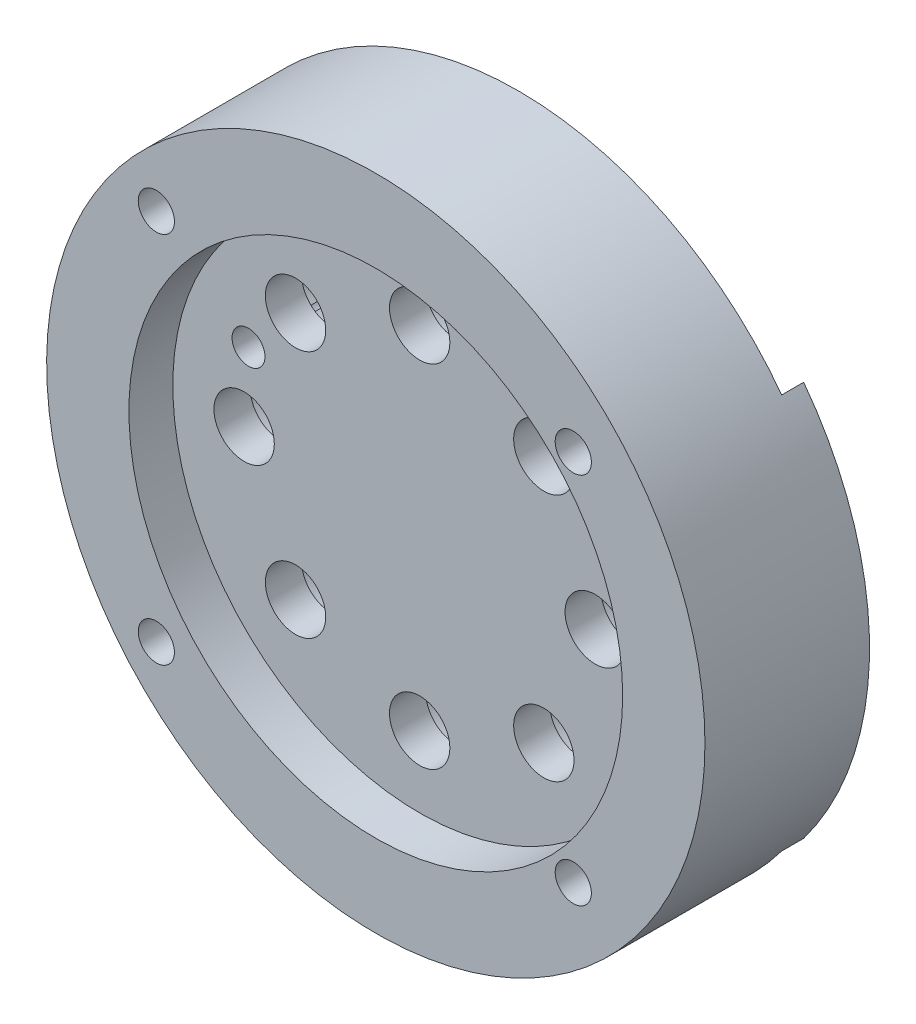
ISO-10303-21;
HEADER;
FILE_DESCRIPTION(('STEP AP214'),'2;1');
FILE_NAME('part.step','',(''),(''),'','','');
FILE_SCHEMA(('AUTOMOTIVE_DESIGN { 1 0 10303 214 1 1 1 1 }'));
ENDSEC;
DATA;
#1=APPLICATION_CONTEXT('core data for automotive mechanical design processes');
#2=APPLICATION_PROTOCOL_DEFINITION('international standard','automotive_design',2000,#1);
#3=PRODUCT_CONTEXT('',#1,'mechanical');
#4=PRODUCT('Part','Part','',(#3));
#5=PRODUCT_RELATED_PRODUCT_CATEGORY('part','',(#4));
#6=PRODUCT_DEFINITION_FORMATION('','',#4);
#7=PRODUCT_DEFINITION_CONTEXT('part definition',#1,'design');
#8=PRODUCT_DEFINITION('design','',#6,#7);
#9=PRODUCT_DEFINITION_SHAPE('','',#8);
#10=(LENGTH_UNIT() NAMED_UNIT(*) SI_UNIT(.MILLI.,.METRE.));
#11=(NAMED_UNIT(*) PLANE_ANGLE_UNIT() SI_UNIT($,.RADIAN.));
#12=(NAMED_UNIT(*) SI_UNIT($,.STERADIAN.) SOLID_ANGLE_UNIT());
#13=UNCERTAINTY_MEASURE_WITH_UNIT(LENGTH_MEASURE(1.E-05),#10,'distance_accuracy_value','');
#14=(GEOMETRIC_REPRESENTATION_CONTEXT(3) GLOBAL_UNCERTAINTY_ASSIGNED_CONTEXT((#13)) GLOBAL_UNIT_ASSIGNED_CONTEXT((#10,
#11,#12)) REPRESENTATION_CONTEXT('',''));
#15=CARTESIAN_POINT('',(0.,0.,0.));
#16=DIRECTION('',(0.,0.,1.));
#17=DIRECTION('',(1.,0.,0.));
#18=AXIS2_PLACEMENT_3D('',#15,#16,#17);
#19=CARTESIAN_POINT('',(-395.662294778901,108.726328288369,0.));
#20=DIRECTION('',(0.,0.,1.));
#21=DIRECTION('',(1.,0.,0.));
#22=AXIS2_PLACEMENT_3D('',#19,#20,#21);
#23=PLANE('',#22);
#24=CARTESIAN_POINT('',(-395.662294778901,108.726328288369,0.));
#25=DIRECTION('',(0.,0.,1.));
#26=DIRECTION('',(1.,0.,0.));
#27=AXIS2_PLACEMENT_3D('',#24,#25,#26);
#28=CIRCLE('',#27,30.);
#29=CARTESIAN_POINT('',(-421.662736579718,123.692190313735,0.));
#30=VERTEX_POINT('',#29);
#31=CARTESIAN_POINT('',(-421.662736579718,93.7604662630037,0.));
#32=VERTEX_POINT('',#31);
#33=EDGE_CURVE('E94',#30,#32,#28,.T.);
#34=ORIENTED_EDGE('',*,*,#33,.F.);
#35=DIRECTION('',(0.,1.,0.));
#36=VECTOR('',#35,1.);
#37=CARTESIAN_POINT('',(-421.662736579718,73.7263282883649,0.));
#38=LINE('',#37,#36);
#39=EDGE_CURVE('E84',#32,#30,#38,.T.);
#40=ORIENTED_EDGE('',*,*,#39,.F.);
#41=EDGE_LOOP('',(#34,#40));
#42=FACE_BOUND('',#41,.T.);
#43=ADVANCED_FACE('F16',(#42),#23,.F.);
#44=CARTESIAN_POINT('',(-371.662736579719,90.7257392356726,0.));
#45=VERTEX_POINT('',#44);
#46=CARTESIAN_POINT('',(-371.662736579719,126.726917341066,0.));
#47=VERTEX_POINT('',#46);
#48=EDGE_CURVE('E101',#45,#47,#28,.T.);
#49=ORIENTED_EDGE('',*,*,#48,.F.);
#50=DIRECTION('',(0.,-1.,0.));
#51=VECTOR('',#50,1.);
#52=CARTESIAN_POINT('',(-371.662736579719,73.7263282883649,0.));
#53=LINE('',#52,#51);
#54=EDGE_CURVE('E95',#47,#45,#53,.T.);
#55=ORIENTED_EDGE('',*,*,#54,.F.);
#56=EDGE_LOOP('',(#49,#55));
#57=FACE_BOUND('',#56,.T.);
#58=ADVANCED_FACE('F165',(#57),#23,.F.);
#59=CARTESIAN_POINT('',(-395.662294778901,108.726328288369,15.));
#60=DIRECTION('',(0.,0.,-1.));
#61=DIRECTION('',(-1.,0.,0.));
#62=AXIS2_PLACEMENT_3D('',#59,#60,#61);
#63=CYLINDRICAL_SURFACE('',#62,30.);
#64=CARTESIAN_POINT('',(-395.662294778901,108.726328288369,2.));
#65=DIRECTION('',(0.,0.,1.));
#66=DIRECTION('',(1.,0.,0.));
#67=AXIS2_PLACEMENT_3D('',#64,#65,#66);
#68=CIRCLE('',#67,30.);
#69=CARTESIAN_POINT('',(-371.662736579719,126.726917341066,2.));
#70=VERTEX_POINT('',#69);
#71=CARTESIAN_POINT('',(-421.662736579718,123.692190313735,2.));
#72=VERTEX_POINT('',#71);
#73=EDGE_CURVE('E159',#70,#72,#68,.T.);
#74=ORIENTED_EDGE('',*,*,#73,.T.);
#75=DIRECTION('',(0.,0.,-1.));
#76=VECTOR('',#75,1.);
#77=CARTESIAN_POINT('',(-421.662736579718,123.692190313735,15.));
#78=LINE('',#77,#76);
#79=EDGE_CURVE('E11',#72,#30,#78,.T.);
#80=ORIENTED_EDGE('',*,*,#79,.T.);
#81=ORIENTED_EDGE('',*,*,#33,.T.);
#82=DIRECTION('',(0.,0.,-1.));
#83=VECTOR('',#82,1.);
#84=CARTESIAN_POINT('',(-421.662736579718,93.7604662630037,15.));
#85=LINE('',#84,#83);
#86=CARTESIAN_POINT('',(-421.662736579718,93.7604662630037,2.));
#87=VERTEX_POINT('',#86);
#88=EDGE_CURVE('E81',#32,#87,#85,.F.);
#89=ORIENTED_EDGE('',*,*,#88,.T.);
#90=CARTESIAN_POINT('',(-371.662736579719,90.7257392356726,2.));
#91=VERTEX_POINT('',#90);
#92=EDGE_CURVE('E192',#87,#91,#68,.T.);
#93=ORIENTED_EDGE('',*,*,#92,.T.);
#94=DIRECTION('',(0.,0.,-1.));
#95=VECTOR('',#94,1.);
#96=CARTESIAN_POINT('',(-371.662736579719,90.7257392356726,15.));
#97=LINE('',#96,#95);
#98=EDGE_CURVE('E90',#91,#45,#97,.T.);
#99=ORIENTED_EDGE('',*,*,#98,.T.);
#100=ORIENTED_EDGE('',*,*,#48,.T.);
#101=DIRECTION('',(0.,0.,-1.));
#102=VECTOR('',#101,1.);
#103=CARTESIAN_POINT('',(-371.662736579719,126.726917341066,15.));
#104=LINE('',#103,#102);
#105=EDGE_CURVE('E24',#47,#70,#104,.F.);
#106=ORIENTED_EDGE('',*,*,#105,.T.);
#107=EDGE_LOOP('',(#74,#80,#81,#89,#93,#99,#100,#106));
#108=FACE_BOUND('',#107,.T.);
#109=CARTESIAN_POINT('',(-395.662294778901,108.726328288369,15.));
#110=DIRECTION('',(0.,0.,1.));
#111=DIRECTION('',(1.,0.,0.));
#112=AXIS2_PLACEMENT_3D('',#109,#110,#111);
#113=CIRCLE('',#112,30.);
#114=CARTESIAN_POINT('',(-365.662294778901,108.726328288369,15.));
#115=VERTEX_POINT('',#114);
#116=EDGE_CURVE('E100',#115,#115,#113,.T.);
#117=ORIENTED_EDGE('',*,*,#116,.F.);
#118=EDGE_LOOP('',(#117));
#119=FACE_BOUND('',#118,.T.);
#120=ADVANCED_FACE('F18',(#108,#119),#63,.T.);
#121=CARTESIAN_POINT('',(-395.662294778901,108.726328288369,15.));
#122=DIRECTION('',(0.,0.,1.));
#123=DIRECTION('',(1.,0.,0.));
#124=AXIS2_PLACEMENT_3D('',#121,#122,#123);
#125=PLANE('',#124);
#126=CARTESIAN_POINT('',(-377.662736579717,91.7263282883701,15.));
#127=DIRECTION('',(0.,0.,-1.));
#128=DIRECTION('',(-1.,0.,0.));
#129=AXIS2_PLACEMENT_3D('',#126,#127,#128);
#130=CIRCLE('',#129,1.65);
#131=CARTESIAN_POINT('',(-379.312736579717,91.7263282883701,15.));
#132=VERTEX_POINT('',#131);
#133=EDGE_CURVE('E400',#132,#132,#130,.T.);
#134=ORIENTED_EDGE('',*,*,#133,.T.);
#135=EDGE_LOOP('',(#134));
#136=FACE_BOUND('',#135,.T.);
#137=CARTESIAN_POINT('',(-377.662736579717,125.72632828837,15.));
#138=DIRECTION('',(0.,0.,-1.));
#139=DIRECTION('',(-1.,0.,0.));
#140=AXIS2_PLACEMENT_3D('',#137,#138,#139);
#141=CIRCLE('',#140,1.65);
#142=CARTESIAN_POINT('',(-379.312736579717,125.72632828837,15.));
#143=VERTEX_POINT('',#142);
#144=EDGE_CURVE('E410',#143,#143,#141,.T.);
#145=ORIENTED_EDGE('',*,*,#144,.T.);
#146=EDGE_LOOP('',(#145));
#147=FACE_BOUND('',#146,.T.);
#148=CARTESIAN_POINT('',(-415.662736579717,125.72632828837,15.));
#149=DIRECTION('',(0.,0.,-1.));
#150=DIRECTION('',(-1.,0.,0.));
#151=AXIS2_PLACEMENT_3D('',#148,#149,#150);
#152=CIRCLE('',#151,1.65);
#153=CARTESIAN_POINT('',(-417.312736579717,125.72632828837,15.));
#154=VERTEX_POINT('',#153);
#155=EDGE_CURVE('E416',#154,#154,#152,.T.);
#156=ORIENTED_EDGE('',*,*,#155,.T.);
#157=EDGE_LOOP('',(#156));
#158=FACE_BOUND('',#157,.T.);
#159=CARTESIAN_POINT('',(-415.662736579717,91.7263282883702,15.));
#160=DIRECTION('',(0.,0.,-1.));
#161=DIRECTION('',(-1.,0.,0.));
#162=AXIS2_PLACEMENT_3D('',#159,#160,#161);
#163=CIRCLE('',#162,1.65);
#164=CARTESIAN_POINT('',(-417.312736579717,91.7263282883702,15.));
#165=VERTEX_POINT('',#164);
#166=EDGE_CURVE('E96',#165,#165,#163,.T.);
#167=ORIENTED_EDGE('',*,*,#166,.T.);
#168=EDGE_LOOP('',(#167));
#169=FACE_BOUND('',#168,.T.);
#170=CARTESIAN_POINT('',(-395.662294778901,108.726328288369,15.));
#171=DIRECTION('',(0.,0.,1.));
#172=DIRECTION('',(1.,0.,0.));
#173=AXIS2_PLACEMENT_3D('',#170,#171,#172);
#174=CIRCLE('',#173,22.5);
#175=CARTESIAN_POINT('',(-373.162294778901,108.726328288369,15.));
#176=VERTEX_POINT('',#175);
#177=EDGE_CURVE('E113',#176,#176,#174,.T.);
#178=ORIENTED_EDGE('',*,*,#177,.F.);
#179=EDGE_LOOP('',(#178));
#180=FACE_BOUND('',#179,.T.);
#181=ORIENTED_EDGE('',*,*,#116,.T.);
#182=EDGE_LOOP('',(#181));
#183=FACE_BOUND('',#182,.T.);
#184=ADVANCED_FACE('F247',(#136,#147,#158,#169,#180,#183),#125,.T.);
#185=CARTESIAN_POINT('',(-395.662294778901,108.726328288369,11.));
#186=DIRECTION('',(0.,0.,1.));
#187=DIRECTION('',(1.,0.,0.));
#188=AXIS2_PLACEMENT_3D('',#185,#186,#187);
#189=CYLINDRICAL_SURFACE('',#188,22.5);
#190=CARTESIAN_POINT('',(-395.662294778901,108.726328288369,11.));
#191=DIRECTION('',(0.,0.,1.));
#192=DIRECTION('',(1.,0.,0.));
#193=AXIS2_PLACEMENT_3D('',#190,#191,#192);
#194=CIRCLE('',#193,22.5);
#195=CARTESIAN_POINT('',(-373.162294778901,108.726328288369,11.));
#196=VERTEX_POINT('',#195);
#197=EDGE_CURVE('E107',#196,#196,#194,.T.);
#198=ORIENTED_EDGE('',*,*,#197,.F.);
#199=EDGE_LOOP('',(#198));
#200=FACE_BOUND('',#199,.T.);
#201=ORIENTED_EDGE('',*,*,#177,.T.);
#202=EDGE_LOOP('',(#201));
#203=FACE_BOUND('',#202,.T.);
#204=ADVANCED_FACE('F245',(#200,#203),#189,.F.);
#205=CARTESIAN_POINT('',(-395.662294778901,108.726328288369,11.));
#206=DIRECTION('',(0.,0.,1.));
#207=DIRECTION('',(1.,0.,0.));
#208=AXIS2_PLACEMENT_3D('',#205,#206,#207);
#209=PLANE('',#208);
#210=CARTESIAN_POINT('',(-411.262294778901,115.18805986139,11.));
#211=DIRECTION('',(0.,0.,1.));
#212=DIRECTION('',(1.,0.,0.));
#213=AXIS2_PLACEMENT_3D('',#210,#211,#212);
#214=CIRCLE('',#213,1.5);
#215=CARTESIAN_POINT('',(-409.762294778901,115.18805986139,11.));
#216=VERTEX_POINT('',#215);
#217=EDGE_CURVE('E205',#216,#216,#214,.T.);
#218=ORIENTED_EDGE('',*,*,#217,.F.);
#219=EDGE_LOOP('',(#218));
#220=FACE_BOUND('',#219,.T.);
#221=CARTESIAN_POINT('',(-384.348586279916,120.040036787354,11.));
#222=DIRECTION('',(0.,0.,1.));
#223=DIRECTION('',(1.,0.,0.));
#224=AXIS2_PLACEMENT_3D('',#221,#222,#223);
#225=CIRCLE('',#224,2.75);
#226=CARTESIAN_POINT('',(-381.598586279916,120.040036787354,11.));
#227=VERTEX_POINT('',#226);
#228=EDGE_CURVE('E145',#227,#227,#225,.T.);
#229=ORIENTED_EDGE('',*,*,#228,.F.);
#230=EDGE_LOOP('',(#229));
#231=FACE_BOUND('',#230,.T.);
#232=CARTESIAN_POINT('',(-379.662294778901,108.72632828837,11.));
#233=DIRECTION('',(0.,0.,1.));
#234=DIRECTION('',(1.,0.,0.));
#235=AXIS2_PLACEMENT_3D('',#232,#233,#234);
#236=CIRCLE('',#235,2.75);
#237=CARTESIAN_POINT('',(-376.912294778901,108.72632828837,11.));
#238=VERTEX_POINT('',#237);
#239=EDGE_CURVE('E140',#238,#238,#236,.T.);
#240=ORIENTED_EDGE('',*,*,#239,.F.);
#241=EDGE_LOOP('',(#240));
#242=FACE_BOUND('',#241,.T.);
#243=CARTESIAN_POINT('',(-384.348586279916,97.4126197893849,11.));
#244=DIRECTION('',(0.,0.,1.));
#245=DIRECTION('',(1.,0.,0.));
#246=AXIS2_PLACEMENT_3D('',#243,#244,#245);
#247=CIRCLE('',#246,2.75);
#248=CARTESIAN_POINT('',(-381.598586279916,97.4126197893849,11.));
#249=VERTEX_POINT('',#248);
#250=EDGE_CURVE('E135',#249,#249,#247,.T.);
#251=ORIENTED_EDGE('',*,*,#250,.F.);
#252=EDGE_LOOP('',(#251));
#253=FACE_BOUND('',#252,.T.);
#254=CARTESIAN_POINT('',(-395.662294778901,92.7263282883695,11.));
#255=DIRECTION('',(0.,0.,1.));
#256=DIRECTION('',(1.,0.,0.));
#257=AXIS2_PLACEMENT_3D('',#254,#255,#256);
#258=CIRCLE('',#257,2.75);
#259=CARTESIAN_POINT('',(-392.912294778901,92.7263282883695,11.));
#260=VERTEX_POINT('',#259);
#261=EDGE_CURVE('E130',#260,#260,#258,.T.);
#262=ORIENTED_EDGE('',*,*,#261,.F.);
#263=EDGE_LOOP('',(#262));
#264=FACE_BOUND('',#263,.T.);
#265=CARTESIAN_POINT('',(-406.976003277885,97.4126197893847,11.));
#266=DIRECTION('',(0.,0.,1.));
#267=DIRECTION('',(1.,0.,0.));
#268=AXIS2_PLACEMENT_3D('',#265,#266,#267);
#269=CIRCLE('',#268,2.75);
#270=CARTESIAN_POINT('',(-404.226003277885,97.4126197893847,11.));
#271=VERTEX_POINT('',#270);
#272=EDGE_CURVE('E125',#271,#271,#269,.T.);
#273=ORIENTED_EDGE('',*,*,#272,.F.);
#274=EDGE_LOOP('',(#273));
#275=FACE_BOUND('',#274,.T.);
#276=CARTESIAN_POINT('',(-411.662294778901,108.726328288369,11.));
#277=DIRECTION('',(0.,0.,1.));
#278=DIRECTION('',(1.,0.,0.));
#279=AXIS2_PLACEMENT_3D('',#276,#277,#278);
#280=CIRCLE('',#279,2.75);
#281=CARTESIAN_POINT('',(-408.912294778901,108.726328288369,11.));
#282=VERTEX_POINT('',#281);
#283=EDGE_CURVE('E120',#282,#282,#280,.T.);
#284=ORIENTED_EDGE('',*,*,#283,.F.);
#285=EDGE_LOOP('',(#284));
#286=FACE_BOUND('',#285,.T.);
#287=CARTESIAN_POINT('',(-406.976003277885,120.040036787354,11.));
#288=DIRECTION('',(0.,0.,1.));
#289=DIRECTION('',(1.,0.,0.));
#290=AXIS2_PLACEMENT_3D('',#287,#288,#289);
#291=CIRCLE('',#290,2.75);
#292=CARTESIAN_POINT('',(-404.226003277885,120.040036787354,11.));
#293=VERTEX_POINT('',#292);
#294=EDGE_CURVE('E115',#293,#293,#291,.T.);
#295=ORIENTED_EDGE('',*,*,#294,.F.);
#296=EDGE_LOOP('',(#295));
#297=FACE_BOUND('',#296,.T.);
#298=CARTESIAN_POINT('',(-395.662294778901,124.726328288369,11.));
#299=DIRECTION('',(0.,0.,1.));
#300=DIRECTION('',(1.,0.,0.));
#301=AXIS2_PLACEMENT_3D('',#298,#299,#300);
#302=CIRCLE('',#301,2.75);
#303=CARTESIAN_POINT('',(-392.912294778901,124.726328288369,11.));
#304=VERTEX_POINT('',#303);
#305=EDGE_CURVE('E110',#304,#304,#302,.T.);
#306=ORIENTED_EDGE('',*,*,#305,.F.);
#307=EDGE_LOOP('',(#306));
#308=FACE_BOUND('',#307,.T.);
#309=ORIENTED_EDGE('',*,*,#197,.T.);
#310=EDGE_LOOP('',(#309));
#311=FACE_BOUND('',#310,.T.);
#312=ADVANCED_FACE('F266',(#220,#231,#242,#253,#264,#275,#286,#297,#308,#311),#209,.T.);
#313=CARTESIAN_POINT('',(-395.662294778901,124.726328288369,0.));
#314=DIRECTION('',(0.,0.,-1.));
#315=DIRECTION('',(-1.,0.,0.));
#316=AXIS2_PLACEMENT_3D('',#313,#314,#315);
#317=CYLINDRICAL_SURFACE('',#316,2.75);
#318=ORIENTED_EDGE('',*,*,#305,.T.);
#319=EDGE_LOOP('',(#318));
#320=FACE_BOUND('',#319,.T.);
#321=CARTESIAN_POINT('',(-395.662294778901,124.726328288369,7.7));
#322=DIRECTION('',(0.,0.,-1.));
#323=DIRECTION('',(-1.,0.,0.));
#324=AXIS2_PLACEMENT_3D('',#321,#322,#323);
#325=CIRCLE('',#324,2.75);
#326=CARTESIAN_POINT('',(-398.412294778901,124.726328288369,7.7));
#327=VERTEX_POINT('',#326);
#328=EDGE_CURVE('E114',#327,#327,#325,.T.);
#329=ORIENTED_EDGE('',*,*,#328,.T.);
#330=EDGE_LOOP('',(#329));
#331=FACE_BOUND('',#330,.T.);
#332=ADVANCED_FACE('F270',(#320,#331),#317,.F.);
#333=CARTESIAN_POINT('',(-392.912294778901,124.726328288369,7.7));
#334=DIRECTION('',(0.,0.,1.));
#335=DIRECTION('',(1.,0.,0.));
#336=AXIS2_PLACEMENT_3D('',#333,#334,#335);
#337=PLANE('',#336);
#338=ORIENTED_EDGE('',*,*,#328,.F.);
#339=EDGE_LOOP('',(#338));
#340=FACE_BOUND('',#339,.T.);
#341=CARTESIAN_POINT('',(-395.662294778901,124.726328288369,7.7));
#342=DIRECTION('',(0.,0.,-1.));
#343=DIRECTION('',(-1.,0.,0.));
#344=AXIS2_PLACEMENT_3D('',#341,#342,#343);
#345=CIRCLE('',#344,5.);
#346=CARTESIAN_POINT('',(-400.662294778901,124.726328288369,7.7));
#347=VERTEX_POINT('',#346);
#348=EDGE_CURVE('E118',#347,#347,#345,.T.);
#349=ORIENTED_EDGE('',*,*,#348,.T.);
#350=EDGE_LOOP('',(#349));
#351=FACE_BOUND('',#350,.T.);
#352=ADVANCED_FACE('F274',(#340,#351),#337,.F.);
#353=CARTESIAN_POINT('',(-395.662294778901,124.726328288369,0.));
#354=DIRECTION('',(0.,0.,-1.));
#355=DIRECTION('',(-1.,0.,0.));
#356=AXIS2_PLACEMENT_3D('',#353,#354,#355);
#357=CYLINDRICAL_SURFACE('',#356,5.);
#358=CARTESIAN_POINT('',(-395.662294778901,124.726328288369,2.));
#359=DIRECTION('',(0.,0.,1.));
#360=DIRECTION('',(1.,0.,0.));
#361=AXIS2_PLACEMENT_3D('',#358,#359,#360);
#362=CIRCLE('',#361,5.);
#363=CARTESIAN_POINT('',(-390.662294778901,124.726328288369,2.));
#364=VERTEX_POINT('',#363);
#365=EDGE_CURVE('E189',#364,#364,#362,.F.);
#366=ORIENTED_EDGE('',*,*,#365,.T.);
#367=EDGE_LOOP('',(#366));
#368=FACE_BOUND('',#367,.T.);
#369=ORIENTED_EDGE('',*,*,#348,.F.);
#370=EDGE_LOOP('',(#369));
#371=FACE_BOUND('',#370,.T.);
#372=ADVANCED_FACE('F278',(#368,#371),#357,.F.);
#373=CARTESIAN_POINT('',(-406.976003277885,120.040036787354,0.));
#374=DIRECTION('',(0.,0.,-1.));
#375=DIRECTION('',(-1.,0.,0.));
#376=AXIS2_PLACEMENT_3D('',#373,#374,#375);
#377=CYLINDRICAL_SURFACE('',#376,2.75);
#378=ORIENTED_EDGE('',*,*,#294,.T.);
#379=EDGE_LOOP('',(#378));
#380=FACE_BOUND('',#379,.T.);
#381=CARTESIAN_POINT('',(-406.976003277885,120.040036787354,7.7));
#382=DIRECTION('',(0.,0.,-1.));
#383=DIRECTION('',(-1.,0.,0.));
#384=AXIS2_PLACEMENT_3D('',#381,#382,#383);
#385=CIRCLE('',#384,2.75);
#386=CARTESIAN_POINT('',(-409.726003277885,120.040036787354,7.7));
#387=VERTEX_POINT('',#386);
#388=EDGE_CURVE('E119',#387,#387,#385,.T.);
#389=ORIENTED_EDGE('',*,*,#388,.T.);
#390=EDGE_LOOP('',(#389));
#391=FACE_BOUND('',#390,.T.);
#392=ADVANCED_FACE('F282',(#380,#391),#377,.F.);
#393=CARTESIAN_POINT('',(-404.226003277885,120.040036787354,7.7));
#394=DIRECTION('',(0.,0.,1.));
#395=DIRECTION('',(1.,0.,0.));
#396=AXIS2_PLACEMENT_3D('',#393,#394,#395);
#397=PLANE('',#396);
#398=ORIENTED_EDGE('',*,*,#388,.F.);
#399=EDGE_LOOP('',(#398));
#400=FACE_BOUND('',#399,.T.);
#401=CARTESIAN_POINT('',(-406.976003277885,120.040036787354,7.7));
#402=DIRECTION('',(0.,0.,-1.));
#403=DIRECTION('',(-1.,0.,0.));
#404=AXIS2_PLACEMENT_3D('',#401,#402,#403);
#405=CIRCLE('',#404,5.);
#406=CARTESIAN_POINT('',(-410.465140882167,116.458707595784,7.7));
#407=VERTEX_POINT('',#406);
#408=CARTESIAN_POINT('',(-410.099663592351,116.135840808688,7.7));
#409=VERTEX_POINT('',#408);
#410=EDGE_CURVE('E123',#407,#409,#405,.T.);
#411=ORIENTED_EDGE('',*,*,#410,.T.);
#412=CARTESIAN_POINT('',(-411.262294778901,115.18805986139,7.7));
#413=DIRECTION('',(0.,0.,1.));
#414=DIRECTION('',(1.,0.,0.));
#415=AXIS2_PLACEMENT_3D('',#412,#413,#414);
#416=CIRCLE('',#415,1.5);
#417=EDGE_CURVE('E199',#409,#407,#416,.T.);
#418=ORIENTED_EDGE('',*,*,#417,.T.);
#419=EDGE_LOOP('',(#411,#418));
#420=FACE_BOUND('',#419,.T.);
#421=ADVANCED_FACE('F286',(#400,#420),#397,.F.);
#422=CARTESIAN_POINT('',(-406.976003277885,120.040036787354,0.));
#423=DIRECTION('',(0.,0.,-1.));
#424=DIRECTION('',(-1.,0.,0.));
#425=AXIS2_PLACEMENT_3D('',#422,#423,#424);
#426=CYLINDRICAL_SURFACE('',#425,5.);
#427=DIRECTION('',(0.,0.,-1.));
#428=VECTOR('',#427,1.);
#429=CARTESIAN_POINT('',(-410.465140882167,116.458707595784,7.5));
#430=LINE('',#429,#428);
#431=CARTESIAN_POINT('',(-410.465140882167,116.458707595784,2.));
#432=VERTEX_POINT('',#431);
#433=EDGE_CURVE('E202',#407,#432,#430,.T.);
#434=ORIENTED_EDGE('',*,*,#433,.T.);
#435=CARTESIAN_POINT('',(-406.976003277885,120.040036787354,2.));
#436=DIRECTION('',(0.,0.,1.));
#437=DIRECTION('',(1.,0.,0.));
#438=AXIS2_PLACEMENT_3D('',#435,#436,#437);
#439=CIRCLE('',#438,5.);
#440=CARTESIAN_POINT('',(-410.099663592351,116.135840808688,2.));
#441=VERTEX_POINT('',#440);
#442=EDGE_CURVE('E171',#432,#441,#439,.F.);
#443=ORIENTED_EDGE('',*,*,#442,.T.);
#444=DIRECTION('',(0.,0.,-1.));
#445=VECTOR('',#444,1.);
#446=CARTESIAN_POINT('',(-410.099663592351,116.135840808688,7.5));
#447=LINE('',#446,#445);
#448=EDGE_CURVE('E197',#441,#409,#447,.F.);
#449=ORIENTED_EDGE('',*,*,#448,.T.);
#450=ORIENTED_EDGE('',*,*,#410,.F.);
#451=EDGE_LOOP('',(#434,#443,#449,#450));
#452=FACE_BOUND('',#451,.T.);
#453=ADVANCED_FACE('F290',(#452),#426,.F.);
#454=CARTESIAN_POINT('',(-411.662294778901,108.726328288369,0.));
#455=DIRECTION('',(0.,0.,-1.));
#456=DIRECTION('',(-1.,0.,0.));
#457=AXIS2_PLACEMENT_3D('',#454,#455,#456);
#458=CYLINDRICAL_SURFACE('',#457,2.75);
#459=ORIENTED_EDGE('',*,*,#283,.T.);
#460=EDGE_LOOP('',(#459));
#461=FACE_BOUND('',#460,.T.);
#462=CARTESIAN_POINT('',(-411.662294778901,108.726328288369,7.7));
#463=DIRECTION('',(0.,0.,-1.));
#464=DIRECTION('',(-1.,0.,0.));
#465=AXIS2_PLACEMENT_3D('',#462,#463,#464);
#466=CIRCLE('',#465,2.75);
#467=CARTESIAN_POINT('',(-414.412294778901,108.726328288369,7.7));
#468=VERTEX_POINT('',#467);
#469=EDGE_CURVE('E124',#468,#468,#466,.T.);
#470=ORIENTED_EDGE('',*,*,#469,.T.);
#471=EDGE_LOOP('',(#470));
#472=FACE_BOUND('',#471,.T.);
#473=ADVANCED_FACE('F294',(#461,#472),#458,.F.);
#474=CARTESIAN_POINT('',(-408.912294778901,108.726328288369,7.7));
#475=DIRECTION('',(0.,0.,1.));
#476=DIRECTION('',(1.,0.,0.));
#477=AXIS2_PLACEMENT_3D('',#474,#475,#476);
#478=PLANE('',#477);
#479=ORIENTED_EDGE('',*,*,#469,.F.);
#480=EDGE_LOOP('',(#479));
#481=FACE_BOUND('',#480,.T.);
#482=CARTESIAN_POINT('',(-411.662294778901,108.726328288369,7.7));
#483=DIRECTION('',(0.,0.,-1.));
#484=DIRECTION('',(-1.,0.,0.));
#485=AXIS2_PLACEMENT_3D('',#482,#483,#484);
#486=CIRCLE('',#485,5.);
#487=CARTESIAN_POINT('',(-411.110372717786,113.695773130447,7.7));
#488=VERTEX_POINT('',#487);
#489=CARTESIAN_POINT('',(-411.597105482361,113.72590330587,7.7));
#490=VERTEX_POINT('',#489);
#491=EDGE_CURVE('E128',#488,#490,#486,.T.);
#492=ORIENTED_EDGE('',*,*,#491,.T.);
#493=CARTESIAN_POINT('',(-411.262294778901,115.18805986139,7.7));
#494=DIRECTION('',(0.,0.,1.));
#495=DIRECTION('',(1.,0.,0.));
#496=AXIS2_PLACEMENT_3D('',#493,#494,#495);
#497=CIRCLE('',#496,1.5);
#498=EDGE_CURVE('E194',#490,#488,#497,.T.);
#499=ORIENTED_EDGE('',*,*,#498,.T.);
#500=EDGE_LOOP('',(#492,#499));
#501=FACE_BOUND('',#500,.T.);
#502=ADVANCED_FACE('F298',(#481,#501),#478,.F.);
#503=CARTESIAN_POINT('',(-411.662294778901,108.726328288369,0.));
#504=DIRECTION('',(0.,0.,-1.));
#505=DIRECTION('',(-1.,0.,0.));
#506=AXIS2_PLACEMENT_3D('',#503,#504,#505);
#507=CYLINDRICAL_SURFACE('',#506,5.);
#508=DIRECTION('',(0.,0.,-1.));
#509=VECTOR('',#508,1.);
#510=CARTESIAN_POINT('',(-411.110372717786,113.695773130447,7.5));
#511=LINE('',#510,#509);
#512=CARTESIAN_POINT('',(-411.110372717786,113.695773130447,2.));
#513=VERTEX_POINT('',#512);
#514=EDGE_CURVE('E151',#488,#513,#511,.T.);
#515=ORIENTED_EDGE('',*,*,#514,.T.);
#516=CARTESIAN_POINT('',(-411.662294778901,108.726328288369,2.));
#517=DIRECTION('',(0.,0.,1.));
#518=DIRECTION('',(1.,0.,0.));
#519=AXIS2_PLACEMENT_3D('',#516,#517,#518);
#520=CIRCLE('',#519,5.);
#521=CARTESIAN_POINT('',(-411.597105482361,113.72590330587,2.));
#522=VERTEX_POINT('',#521);
#523=EDGE_CURVE('E39',#513,#522,#520,.F.);
#524=ORIENTED_EDGE('',*,*,#523,.T.);
#525=DIRECTION('',(0.,0.,-1.));
#526=VECTOR('',#525,1.);
#527=CARTESIAN_POINT('',(-411.597105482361,113.72590330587,7.5));
#528=LINE('',#527,#526);
#529=EDGE_CURVE('E104',#522,#490,#528,.F.);
#530=ORIENTED_EDGE('',*,*,#529,.T.);
#531=ORIENTED_EDGE('',*,*,#491,.F.);
#532=EDGE_LOOP('',(#515,#524,#530,#531));
#533=FACE_BOUND('',#532,.T.);
#534=ADVANCED_FACE('F302',(#533),#507,.F.);
#535=CARTESIAN_POINT('',(-406.976003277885,97.4126197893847,0.));
#536=DIRECTION('',(0.,0.,-1.));
#537=DIRECTION('',(-1.,0.,0.));
#538=AXIS2_PLACEMENT_3D('',#535,#536,#537);
#539=CYLINDRICAL_SURFACE('',#538,2.75);
#540=ORIENTED_EDGE('',*,*,#272,.T.);
#541=EDGE_LOOP('',(#540));
#542=FACE_BOUND('',#541,.T.);
#543=CARTESIAN_POINT('',(-406.976003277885,97.4126197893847,7.7));
#544=DIRECTION('',(0.,0.,-1.));
#545=DIRECTION('',(-1.,0.,0.));
#546=AXIS2_PLACEMENT_3D('',#543,#544,#545);
#547=CIRCLE('',#546,2.75);
#548=CARTESIAN_POINT('',(-409.726003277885,97.4126197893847,7.7));
#549=VERTEX_POINT('',#548);
#550=EDGE_CURVE('E129',#549,#549,#547,.T.);
#551=ORIENTED_EDGE('',*,*,#550,.T.);
#552=EDGE_LOOP('',(#551));
#553=FACE_BOUND('',#552,.T.);
#554=ADVANCED_FACE('F306',(#542,#553),#539,.F.);
#555=CARTESIAN_POINT('',(-404.226003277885,97.4126197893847,7.7));
#556=DIRECTION('',(0.,0.,1.));
#557=DIRECTION('',(1.,0.,0.));
#558=AXIS2_PLACEMENT_3D('',#555,#556,#557);
#559=PLANE('',#558);
#560=ORIENTED_EDGE('',*,*,#550,.F.);
#561=EDGE_LOOP('',(#560));
#562=FACE_BOUND('',#561,.T.);
#563=CARTESIAN_POINT('',(-406.976003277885,97.4126197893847,7.7));
#564=DIRECTION('',(0.,0.,-1.));
#565=DIRECTION('',(-1.,0.,0.));
#566=AXIS2_PLACEMENT_3D('',#563,#564,#565);
#567=CIRCLE('',#566,5.);
#568=CARTESIAN_POINT('',(-411.976003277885,97.4126197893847,7.7));
#569=VERTEX_POINT('',#568);
#570=EDGE_CURVE('E133',#569,#569,#567,.T.);
#571=ORIENTED_EDGE('',*,*,#570,.T.);
#572=EDGE_LOOP('',(#571));
#573=FACE_BOUND('',#572,.T.);
#574=ADVANCED_FACE('F310',(#562,#573),#559,.F.);
#575=CARTESIAN_POINT('',(-406.976003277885,97.4126197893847,0.));
#576=DIRECTION('',(0.,0.,-1.));
#577=DIRECTION('',(-1.,0.,0.));
#578=AXIS2_PLACEMENT_3D('',#575,#576,#577);
#579=CYLINDRICAL_SURFACE('',#578,5.);
#580=CARTESIAN_POINT('',(-406.976003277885,97.4126197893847,2.));
#581=DIRECTION('',(0.,0.,1.));
#582=DIRECTION('',(1.,0.,0.));
#583=AXIS2_PLACEMENT_3D('',#580,#581,#582);
#584=CIRCLE('',#583,5.);
#585=CARTESIAN_POINT('',(-401.976003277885,97.4126197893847,2.));
#586=VERTEX_POINT('',#585);
#587=EDGE_CURVE('E186',#586,#586,#584,.F.);
#588=ORIENTED_EDGE('',*,*,#587,.T.);
#589=EDGE_LOOP('',(#588));
#590=FACE_BOUND('',#589,.T.);
#591=ORIENTED_EDGE('',*,*,#570,.F.);
#592=EDGE_LOOP('',(#591));
#593=FACE_BOUND('',#592,.T.);
#594=ADVANCED_FACE('F314',(#590,#593),#579,.F.);
#595=CARTESIAN_POINT('',(-395.662294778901,92.7263282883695,0.));
#596=DIRECTION('',(0.,0.,-1.));
#597=DIRECTION('',(-1.,0.,0.));
#598=AXIS2_PLACEMENT_3D('',#595,#596,#597);
#599=CYLINDRICAL_SURFACE('',#598,2.75);
#600=ORIENTED_EDGE('',*,*,#261,.T.);
#601=EDGE_LOOP('',(#600));
#602=FACE_BOUND('',#601,.T.);
#603=CARTESIAN_POINT('',(-395.662294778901,92.7263282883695,7.7));
#604=DIRECTION('',(0.,0.,-1.));
#605=DIRECTION('',(-1.,0.,0.));
#606=AXIS2_PLACEMENT_3D('',#603,#604,#605);
#607=CIRCLE('',#606,2.75);
#608=CARTESIAN_POINT('',(-398.412294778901,92.7263282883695,7.7));
#609=VERTEX_POINT('',#608);
#610=EDGE_CURVE('E134',#609,#609,#607,.T.);
#611=ORIENTED_EDGE('',*,*,#610,.T.);
#612=EDGE_LOOP('',(#611));
#613=FACE_BOUND('',#612,.T.);
#614=ADVANCED_FACE('F318',(#602,#613),#599,.F.);
#615=CARTESIAN_POINT('',(-392.912294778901,92.7263282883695,7.7));
#616=DIRECTION('',(0.,0.,1.));
#617=DIRECTION('',(1.,0.,0.));
#618=AXIS2_PLACEMENT_3D('',#615,#616,#617);
#619=PLANE('',#618);
#620=ORIENTED_EDGE('',*,*,#610,.F.);
#621=EDGE_LOOP('',(#620));
#622=FACE_BOUND('',#621,.T.);
#623=CARTESIAN_POINT('',(-395.662294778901,92.7263282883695,7.7));
#624=DIRECTION('',(0.,0.,-1.));
#625=DIRECTION('',(-1.,0.,0.));
#626=AXIS2_PLACEMENT_3D('',#623,#624,#625);
#627=CIRCLE('',#626,5.);
#628=CARTESIAN_POINT('',(-400.662294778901,92.7263282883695,7.7));
#629=VERTEX_POINT('',#628);
#630=EDGE_CURVE('E138',#629,#629,#627,.T.);
#631=ORIENTED_EDGE('',*,*,#630,.T.);
#632=EDGE_LOOP('',(#631));
#633=FACE_BOUND('',#632,.T.);
#634=ADVANCED_FACE('F322',(#622,#633),#619,.F.);
#635=CARTESIAN_POINT('',(-395.662294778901,92.7263282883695,0.));
#636=DIRECTION('',(0.,0.,-1.));
#637=DIRECTION('',(-1.,0.,0.));
#638=AXIS2_PLACEMENT_3D('',#635,#636,#637);
#639=CYLINDRICAL_SURFACE('',#638,5.);
#640=CARTESIAN_POINT('',(-395.662294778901,92.7263282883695,2.));
#641=DIRECTION('',(0.,0.,1.));
#642=DIRECTION('',(1.,0.,0.));
#643=AXIS2_PLACEMENT_3D('',#640,#641,#642);
#644=CIRCLE('',#643,5.);
#645=CARTESIAN_POINT('',(-390.662294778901,92.7263282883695,2.));
#646=VERTEX_POINT('',#645);
#647=EDGE_CURVE('E183',#646,#646,#644,.F.);
#648=ORIENTED_EDGE('',*,*,#647,.T.);
#649=EDGE_LOOP('',(#648));
#650=FACE_BOUND('',#649,.T.);
#651=ORIENTED_EDGE('',*,*,#630,.F.);
#652=EDGE_LOOP('',(#651));
#653=FACE_BOUND('',#652,.T.);
#654=ADVANCED_FACE('F326',(#650,#653),#639,.F.);
#655=CARTESIAN_POINT('',(-384.348586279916,97.4126197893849,0.));
#656=DIRECTION('',(0.,0.,-1.));
#657=DIRECTION('',(-1.,0.,0.));
#658=AXIS2_PLACEMENT_3D('',#655,#656,#657);
#659=CYLINDRICAL_SURFACE('',#658,2.75);
#660=ORIENTED_EDGE('',*,*,#250,.T.);
#661=EDGE_LOOP('',(#660));
#662=FACE_BOUND('',#661,.T.);
#663=CARTESIAN_POINT('',(-384.348586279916,97.4126197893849,7.7));
#664=DIRECTION('',(0.,0.,-1.));
#665=DIRECTION('',(-1.,0.,0.));
#666=AXIS2_PLACEMENT_3D('',#663,#664,#665);
#667=CIRCLE('',#666,2.75);
#668=CARTESIAN_POINT('',(-387.098586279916,97.4126197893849,7.7));
#669=VERTEX_POINT('',#668);
#670=EDGE_CURVE('E139',#669,#669,#667,.T.);
#671=ORIENTED_EDGE('',*,*,#670,.T.);
#672=EDGE_LOOP('',(#671));
#673=FACE_BOUND('',#672,.T.);
#674=ADVANCED_FACE('F330',(#662,#673),#659,.F.);
#675=CARTESIAN_POINT('',(-381.598586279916,97.4126197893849,7.7));
#676=DIRECTION('',(0.,0.,1.));
#677=DIRECTION('',(1.,0.,0.));
#678=AXIS2_PLACEMENT_3D('',#675,#676,#677);
#679=PLANE('',#678);
#680=ORIENTED_EDGE('',*,*,#670,.F.);
#681=EDGE_LOOP('',(#680));
#682=FACE_BOUND('',#681,.T.);
#683=CARTESIAN_POINT('',(-384.348586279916,97.4126197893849,7.7));
#684=DIRECTION('',(0.,0.,-1.));
#685=DIRECTION('',(-1.,0.,0.));
#686=AXIS2_PLACEMENT_3D('',#683,#684,#685);
#687=CIRCLE('',#686,5.);
#688=CARTESIAN_POINT('',(-389.348586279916,97.4126197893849,7.7));
#689=VERTEX_POINT('',#688);
#690=EDGE_CURVE('E143',#689,#689,#687,.T.);
#691=ORIENTED_EDGE('',*,*,#690,.T.);
#692=EDGE_LOOP('',(#691));
#693=FACE_BOUND('',#692,.T.);
#694=ADVANCED_FACE('F334',(#682,#693),#679,.F.);
#695=CARTESIAN_POINT('',(-384.348586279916,97.4126197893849,0.));
#696=DIRECTION('',(0.,0.,-1.));
#697=DIRECTION('',(-1.,0.,0.));
#698=AXIS2_PLACEMENT_3D('',#695,#696,#697);
#699=CYLINDRICAL_SURFACE('',#698,5.);
#700=CARTESIAN_POINT('',(-384.348586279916,97.4126197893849,2.));
#701=DIRECTION('',(0.,0.,1.));
#702=DIRECTION('',(1.,0.,0.));
#703=AXIS2_PLACEMENT_3D('',#700,#701,#702);
#704=CIRCLE('',#703,5.);
#705=CARTESIAN_POINT('',(-379.348586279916,97.4126197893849,2.));
#706=VERTEX_POINT('',#705);
#707=EDGE_CURVE('E180',#706,#706,#704,.F.);
#708=ORIENTED_EDGE('',*,*,#707,.T.);
#709=EDGE_LOOP('',(#708));
#710=FACE_BOUND('',#709,.T.);
#711=ORIENTED_EDGE('',*,*,#690,.F.);
#712=EDGE_LOOP('',(#711));
#713=FACE_BOUND('',#712,.T.);
#714=ADVANCED_FACE('F338',(#710,#713),#699,.F.);
#715=CARTESIAN_POINT('',(-379.662294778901,108.72632828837,0.));
#716=DIRECTION('',(0.,0.,-1.));
#717=DIRECTION('',(-1.,0.,0.));
#718=AXIS2_PLACEMENT_3D('',#715,#716,#717);
#719=CYLINDRICAL_SURFACE('',#718,2.75);
#720=ORIENTED_EDGE('',*,*,#239,.T.);
#721=EDGE_LOOP('',(#720));
#722=FACE_BOUND('',#721,.T.);
#723=CARTESIAN_POINT('',(-379.662294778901,108.72632828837,7.7));
#724=DIRECTION('',(0.,0.,-1.));
#725=DIRECTION('',(-1.,0.,0.));
#726=AXIS2_PLACEMENT_3D('',#723,#724,#725);
#727=CIRCLE('',#726,2.75);
#728=CARTESIAN_POINT('',(-382.412294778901,108.72632828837,7.7));
#729=VERTEX_POINT('',#728);
#730=EDGE_CURVE('E144',#729,#729,#727,.T.);
#731=ORIENTED_EDGE('',*,*,#730,.T.);
#732=EDGE_LOOP('',(#731));
#733=FACE_BOUND('',#732,.T.);
#734=ADVANCED_FACE('F342',(#722,#733),#719,.F.);
#735=CARTESIAN_POINT('',(-376.912294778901,108.72632828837,7.7));
#736=DIRECTION('',(0.,0.,1.));
#737=DIRECTION('',(1.,0.,0.));
#738=AXIS2_PLACEMENT_3D('',#735,#736,#737);
#739=PLANE('',#738);
#740=ORIENTED_EDGE('',*,*,#730,.F.);
#741=EDGE_LOOP('',(#740));
#742=FACE_BOUND('',#741,.T.);
#743=CARTESIAN_POINT('',(-379.662294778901,108.72632828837,7.7));
#744=DIRECTION('',(0.,0.,-1.));
#745=DIRECTION('',(-1.,0.,0.));
#746=AXIS2_PLACEMENT_3D('',#743,#744,#745);
#747=CIRCLE('',#746,5.);
#748=CARTESIAN_POINT('',(-384.662294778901,108.72632828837,7.7));
#749=VERTEX_POINT('',#748);
#750=EDGE_CURVE('E148',#749,#749,#747,.T.);
#751=ORIENTED_EDGE('',*,*,#750,.T.);
#752=EDGE_LOOP('',(#751));
#753=FACE_BOUND('',#752,.T.);
#754=ADVANCED_FACE('F346',(#742,#753),#739,.F.);
#755=CARTESIAN_POINT('',(-379.662294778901,108.72632828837,0.));
#756=DIRECTION('',(0.,0.,-1.));
#757=DIRECTION('',(-1.,0.,0.));
#758=AXIS2_PLACEMENT_3D('',#755,#756,#757);
#759=CYLINDRICAL_SURFACE('',#758,5.);
#760=CARTESIAN_POINT('',(-379.662294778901,108.72632828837,2.));
#761=DIRECTION('',(0.,0.,1.));
#762=DIRECTION('',(1.,0.,0.));
#763=AXIS2_PLACEMENT_3D('',#760,#761,#762);
#764=CIRCLE('',#763,5.);
#765=CARTESIAN_POINT('',(-374.662294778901,108.72632828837,2.));
#766=VERTEX_POINT('',#765);
#767=EDGE_CURVE('E177',#766,#766,#764,.F.);
#768=ORIENTED_EDGE('',*,*,#767,.T.);
#769=EDGE_LOOP('',(#768));
#770=FACE_BOUND('',#769,.T.);
#771=ORIENTED_EDGE('',*,*,#750,.F.);
#772=EDGE_LOOP('',(#771));
#773=FACE_BOUND('',#772,.T.);
#774=ADVANCED_FACE('F350',(#770,#773),#759,.F.);
#775=CARTESIAN_POINT('',(-384.348586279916,120.040036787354,0.));
#776=DIRECTION('',(0.,0.,-1.));
#777=DIRECTION('',(-1.,0.,0.));
#778=AXIS2_PLACEMENT_3D('',#775,#776,#777);
#779=CYLINDRICAL_SURFACE('',#778,2.75);
#780=ORIENTED_EDGE('',*,*,#228,.T.);
#781=EDGE_LOOP('',(#780));
#782=FACE_BOUND('',#781,.T.);
#783=CARTESIAN_POINT('',(-384.348586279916,120.040036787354,7.7));
#784=DIRECTION('',(0.,0.,-1.));
#785=DIRECTION('',(-1.,0.,0.));
#786=AXIS2_PLACEMENT_3D('',#783,#784,#785);
#787=CIRCLE('',#786,2.75);
#788=CARTESIAN_POINT('',(-387.098586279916,120.040036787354,7.7));
#789=VERTEX_POINT('',#788);
#790=EDGE_CURVE('E149',#789,#789,#787,.T.);
#791=ORIENTED_EDGE('',*,*,#790,.T.);
#792=EDGE_LOOP('',(#791));
#793=FACE_BOUND('',#792,.T.);
#794=ADVANCED_FACE('F354',(#782,#793),#779,.F.);
#795=CARTESIAN_POINT('',(-381.598586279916,120.040036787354,7.7));
#796=DIRECTION('',(0.,0.,1.));
#797=DIRECTION('',(1.,0.,0.));
#798=AXIS2_PLACEMENT_3D('',#795,#796,#797);
#799=PLANE('',#798);
#800=ORIENTED_EDGE('',*,*,#790,.F.);
#801=EDGE_LOOP('',(#800));
#802=FACE_BOUND('',#801,.T.);
#803=CARTESIAN_POINT('',(-384.348586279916,120.040036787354,7.7));
#804=DIRECTION('',(0.,0.,-1.));
#805=DIRECTION('',(-1.,0.,0.));
#806=AXIS2_PLACEMENT_3D('',#803,#804,#805);
#807=CIRCLE('',#806,5.);
#808=CARTESIAN_POINT('',(-389.348586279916,120.040036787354,7.7));
#809=VERTEX_POINT('',#808);
#810=EDGE_CURVE('E208',#809,#809,#807,.T.);
#811=ORIENTED_EDGE('',*,*,#810,.T.);
#812=EDGE_LOOP('',(#811));
#813=FACE_BOUND('',#812,.T.);
#814=ADVANCED_FACE('F358',(#802,#813),#799,.F.);
#815=CARTESIAN_POINT('',(-384.348586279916,120.040036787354,0.));
#816=DIRECTION('',(0.,0.,-1.));
#817=DIRECTION('',(-1.,0.,0.));
#818=AXIS2_PLACEMENT_3D('',#815,#816,#817);
#819=CYLINDRICAL_SURFACE('',#818,5.);
#820=CARTESIAN_POINT('',(-384.348586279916,120.040036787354,2.));
#821=DIRECTION('',(0.,0.,1.));
#822=DIRECTION('',(1.,0.,0.));
#823=AXIS2_PLACEMENT_3D('',#820,#821,#822);
#824=CIRCLE('',#823,5.);
#825=CARTESIAN_POINT('',(-379.348586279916,120.040036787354,2.));
#826=VERTEX_POINT('',#825);
#827=EDGE_CURVE('E174',#826,#826,#824,.F.);
#828=ORIENTED_EDGE('',*,*,#827,.T.);
#829=EDGE_LOOP('',(#828));
#830=FACE_BOUND('',#829,.T.);
#831=ORIENTED_EDGE('',*,*,#810,.F.);
#832=EDGE_LOOP('',(#831));
#833=FACE_BOUND('',#832,.T.);
#834=ADVANCED_FACE('F362',(#830,#833),#819,.F.);
#835=CARTESIAN_POINT('',(-411.262294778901,115.18805986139,0.));
#836=DIRECTION('',(0.,0.,-1.));
#837=DIRECTION('',(-1.,0.,0.));
#838=AXIS2_PLACEMENT_3D('',#835,#836,#837);
#839=CYLINDRICAL_SURFACE('',#838,1.5);
#840=ORIENTED_EDGE('',*,*,#217,.T.);
#841=EDGE_LOOP('',(#840));
#842=FACE_BOUND('',#841,.T.);
#843=ORIENTED_EDGE('',*,*,#529,.F.);
#844=CARTESIAN_POINT('',(-411.262294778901,115.18805986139,2.));
#845=DIRECTION('',(0.,0.,1.));
#846=DIRECTION('',(1.,0.,0.));
#847=AXIS2_PLACEMENT_3D('',#844,#845,#846);
#848=CIRCLE('',#847,1.5);
#849=EDGE_CURVE('E156',#522,#432,#848,.F.);
#850=ORIENTED_EDGE('',*,*,#849,.T.);
#851=ORIENTED_EDGE('',*,*,#433,.F.);
#852=ORIENTED_EDGE('',*,*,#417,.F.);
#853=ORIENTED_EDGE('',*,*,#448,.F.);
#854=EDGE_CURVE('E154',#441,#513,#848,.F.);
#855=ORIENTED_EDGE('',*,*,#854,.T.);
#856=ORIENTED_EDGE('',*,*,#514,.F.);
#857=ORIENTED_EDGE('',*,*,#498,.F.);
#858=EDGE_LOOP('',(#843,#850,#851,#852,#853,#855,#856,#857));
#859=FACE_BOUND('',#858,.T.);
#860=ADVANCED_FACE('F366',(#842,#859),#839,.F.);
#861=CARTESIAN_POINT('',(-421.662736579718,73.7263282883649,2.));
#862=DIRECTION('',(-1.,0.,0.));
#863=DIRECTION('',(0.,0.,1.));
#864=AXIS2_PLACEMENT_3D('',#861,#862,#863);
#865=PLANE('',#864);
#866=DIRECTION('',(0.,1.,0.));
#867=VECTOR('',#866,1.);
#868=CARTESIAN_POINT('',(-421.662736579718,73.7263282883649,2.));
#869=LINE('',#868,#867);
#870=EDGE_CURVE('E86',#87,#72,#869,.T.);
#871=ORIENTED_EDGE('',*,*,#870,.F.);
#872=ORIENTED_EDGE('',*,*,#88,.F.);
#873=ORIENTED_EDGE('',*,*,#39,.T.);
#874=ORIENTED_EDGE('',*,*,#79,.F.);
#875=EDGE_LOOP('',(#871,#872,#873,#874));
#876=FACE_BOUND('',#875,.T.);
#877=ADVANCED_FACE('F83',(#876),#865,.F.);
#878=CARTESIAN_POINT('',(-371.662736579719,73.7263282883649,2.));
#879=DIRECTION('',(1.,0.,0.));
#880=DIRECTION('',(0.,0.,-1.));
#881=AXIS2_PLACEMENT_3D('',#878,#879,#880);
#882=PLANE('',#881);
#883=DIRECTION('',(0.,-1.,0.));
#884=VECTOR('',#883,1.);
#885=CARTESIAN_POINT('',(-371.662736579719,73.7263282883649,2.));
#886=LINE('',#885,#884);
#887=EDGE_CURVE('E31',#70,#91,#886,.T.);
#888=ORIENTED_EDGE('',*,*,#887,.F.);
#889=ORIENTED_EDGE('',*,*,#105,.F.);
#890=ORIENTED_EDGE('',*,*,#54,.T.);
#891=ORIENTED_EDGE('',*,*,#98,.F.);
#892=EDGE_LOOP('',(#888,#889,#890,#891));
#893=FACE_BOUND('',#892,.T.);
#894=ADVANCED_FACE('F163',(#893),#882,.F.);
#895=CARTESIAN_POINT('',(0.,0.,2.));
#896=DIRECTION('',(0.,0.,1.));
#897=DIRECTION('',(1.,0.,0.));
#898=AXIS2_PLACEMENT_3D('',#895,#896,#897);
#899=PLANE('',#898);
#900=CARTESIAN_POINT('',(-377.662736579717,91.7263282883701,2.));
#901=DIRECTION('',(0.,0.,-1.));
#902=DIRECTION('',(-1.,0.,0.));
#903=AXIS2_PLACEMENT_3D('',#900,#901,#902);
#904=CIRCLE('',#903,1.65);
#905=CARTESIAN_POINT('',(-379.312736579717,91.7263282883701,2.));
#906=VERTEX_POINT('',#905);
#907=EDGE_CURVE('E403',#906,#906,#904,.T.);
#908=ORIENTED_EDGE('',*,*,#907,.F.);
#909=EDGE_LOOP('',(#908));
#910=FACE_BOUND('',#909,.T.);
#911=CARTESIAN_POINT('',(-377.662736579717,125.72632828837,2.));
#912=DIRECTION('',(0.,0.,-1.));
#913=DIRECTION('',(-1.,0.,0.));
#914=AXIS2_PLACEMENT_3D('',#911,#912,#913);
#915=CIRCLE('',#914,1.65);
#916=CARTESIAN_POINT('',(-379.312736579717,125.72632828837,2.));
#917=VERTEX_POINT('',#916);
#918=EDGE_CURVE('E405',#917,#917,#915,.T.);
#919=ORIENTED_EDGE('',*,*,#918,.F.);
#920=EDGE_LOOP('',(#919));
#921=FACE_BOUND('',#920,.T.);
#922=CARTESIAN_POINT('',(-415.662736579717,125.72632828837,2.));
#923=DIRECTION('',(0.,0.,-1.));
#924=DIRECTION('',(-1.,0.,0.));
#925=AXIS2_PLACEMENT_3D('',#922,#923,#924);
#926=CIRCLE('',#925,1.65);
#927=CARTESIAN_POINT('',(-417.312736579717,125.72632828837,2.));
#928=VERTEX_POINT('',#927);
#929=EDGE_CURVE('E413',#928,#928,#926,.T.);
#930=ORIENTED_EDGE('',*,*,#929,.F.);
#931=EDGE_LOOP('',(#930));
#932=FACE_BOUND('',#931,.T.);
#933=CARTESIAN_POINT('',(-415.662736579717,91.7263282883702,2.));
#934=DIRECTION('',(0.,0.,-1.));
#935=DIRECTION('',(-1.,0.,0.));
#936=AXIS2_PLACEMENT_3D('',#933,#934,#935);
#937=CIRCLE('',#936,1.65);
#938=CARTESIAN_POINT('',(-417.312736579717,91.7263282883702,2.));
#939=VERTEX_POINT('',#938);
#940=EDGE_CURVE('E419',#939,#939,#937,.T.);
#941=ORIENTED_EDGE('',*,*,#940,.F.);
#942=EDGE_LOOP('',(#941));
#943=FACE_BOUND('',#942,.T.);
#944=ORIENTED_EDGE('',*,*,#587,.F.);
#945=EDGE_LOOP('',(#944));
#946=FACE_BOUND('',#945,.T.);
#947=ORIENTED_EDGE('',*,*,#707,.F.);
#948=EDGE_LOOP('',(#947));
#949=FACE_BOUND('',#948,.T.);
#950=ORIENTED_EDGE('',*,*,#827,.F.);
#951=EDGE_LOOP('',(#950));
#952=FACE_BOUND('',#951,.T.);
#953=ORIENTED_EDGE('',*,*,#523,.F.);
#954=ORIENTED_EDGE('',*,*,#854,.F.);
#955=ORIENTED_EDGE('',*,*,#442,.F.);
#956=ORIENTED_EDGE('',*,*,#849,.F.);
#957=EDGE_LOOP('',(#953,#954,#955,#956));
#958=FACE_BOUND('',#957,.T.);
#959=ORIENTED_EDGE('',*,*,#767,.F.);
#960=EDGE_LOOP('',(#959));
#961=FACE_BOUND('',#960,.T.);
#962=ORIENTED_EDGE('',*,*,#647,.F.);
#963=EDGE_LOOP('',(#962));
#964=FACE_BOUND('',#963,.T.);
#965=ORIENTED_EDGE('',*,*,#365,.F.);
#966=EDGE_LOOP('',(#965));
#967=FACE_BOUND('',#966,.T.);
#968=ORIENTED_EDGE('',*,*,#887,.T.);
#969=ORIENTED_EDGE('',*,*,#92,.F.);
#970=ORIENTED_EDGE('',*,*,#870,.T.);
#971=ORIENTED_EDGE('',*,*,#73,.F.);
#972=EDGE_LOOP('',(#968,#969,#970,#971));
#973=FACE_BOUND('',#972,.T.);
#974=ADVANCED_FACE('F375',(#910,#921,#932,#943,#946,#949,#952,#958,#961,#964,#967,#973),#899,.F.);
#975=CARTESIAN_POINT('',(-415.662736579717,91.7263282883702,2.));
#976=DIRECTION('',(0.,0.,-1.));
#977=DIRECTION('',(-1.,0.,0.));
#978=AXIS2_PLACEMENT_3D('',#975,#976,#977);
#979=CYLINDRICAL_SURFACE('',#978,1.65);
#980=ORIENTED_EDGE('',*,*,#166,.F.);
#981=EDGE_LOOP('',(#980));
#982=FACE_BOUND('',#981,.T.);
#983=ORIENTED_EDGE('',*,*,#940,.T.);
#984=EDGE_LOOP('',(#983));
#985=FACE_BOUND('',#984,.T.);
#986=ADVANCED_FACE('F378',(#982,#985),#979,.F.);
#987=CARTESIAN_POINT('',(-415.662736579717,125.72632828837,2.));
#988=DIRECTION('',(0.,0.,-1.));
#989=DIRECTION('',(-1.,0.,0.));
#990=AXIS2_PLACEMENT_3D('',#987,#988,#989);
#991=CYLINDRICAL_SURFACE('',#990,1.65);
#992=ORIENTED_EDGE('',*,*,#155,.F.);
#993=EDGE_LOOP('',(#992));
#994=FACE_BOUND('',#993,.T.);
#995=ORIENTED_EDGE('',*,*,#929,.T.);
#996=EDGE_LOOP('',(#995));
#997=FACE_BOUND('',#996,.T.);
#998=ADVANCED_FACE('F382',(#994,#997),#991,.F.);
#999=CARTESIAN_POINT('',(-377.662736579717,125.72632828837,2.));
#1000=DIRECTION('',(0.,0.,-1.));
#1001=DIRECTION('',(-1.,0.,0.));
#1002=AXIS2_PLACEMENT_3D('',#999,#1000,#1001);
#1003=CYLINDRICAL_SURFACE('',#1002,1.65);
#1004=ORIENTED_EDGE('',*,*,#144,.F.);
#1005=EDGE_LOOP('',(#1004));
#1006=FACE_BOUND('',#1005,.T.);
#1007=ORIENTED_EDGE('',*,*,#918,.T.);
#1008=EDGE_LOOP('',(#1007));
#1009=FACE_BOUND('',#1008,.T.);
#1010=ADVANCED_FACE('F386',(#1006,#1009),#1003,.F.);
#1011=CARTESIAN_POINT('',(-377.662736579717,91.7263282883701,2.));
#1012=DIRECTION('',(0.,0.,-1.));
#1013=DIRECTION('',(-1.,0.,0.));
#1014=AXIS2_PLACEMENT_3D('',#1011,#1012,#1013);
#1015=CYLINDRICAL_SURFACE('',#1014,1.65);
#1016=ORIENTED_EDGE('',*,*,#133,.F.);
#1017=EDGE_LOOP('',(#1016));
#1018=FACE_BOUND('',#1017,.T.);
#1019=ORIENTED_EDGE('',*,*,#907,.T.);
#1020=EDGE_LOOP('',(#1019));
#1021=FACE_BOUND('',#1020,.T.);
#1022=ADVANCED_FACE('F390',(#1018,#1021),#1015,.F.);
#1023=CLOSED_SHELL('',(#43,#58,#120,#184,#204,#312,#332,#352,#372,#392,#421,#453,#473,#502,#534,
#554,#574,#594,#614,#634,#654,#674,#694,#714,#734,#754,#774,#794,#814,#834,#860,#877,#894,#974,
#986,#998,#1010,#1022));
#1024=MANIFOLD_SOLID_BREP('B1',#1023);
#1025=ADVANCED_BREP_SHAPE_REPRESENTATION('',(#18,#1024),#14);
#1026=SHAPE_DEFINITION_REPRESENTATION(#9,#1025);
ENDSEC;
END-ISO-10303-21;
